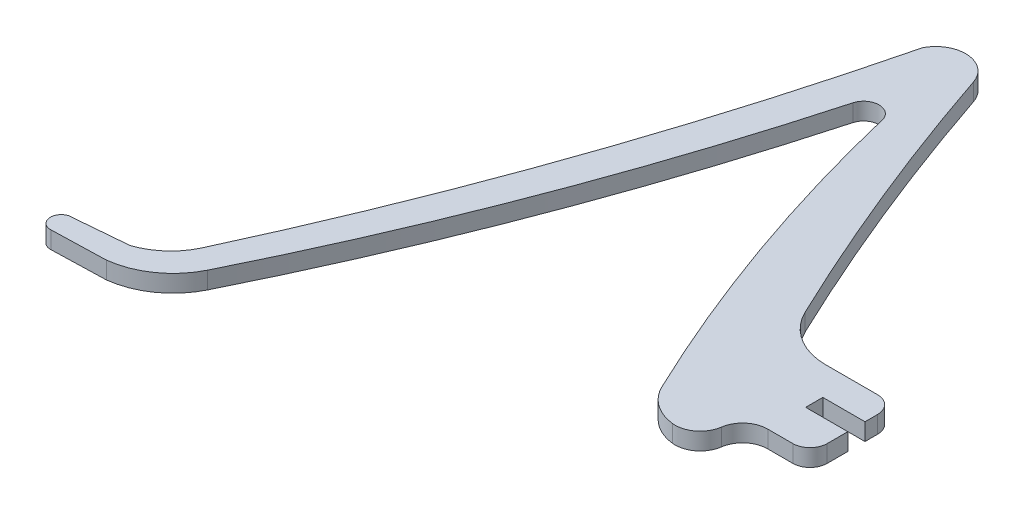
ISO-10303-21;
HEADER;
FILE_DESCRIPTION(('STEP AP214'),'2;1');
FILE_NAME('part.step','',(''),(''),'','','');
FILE_SCHEMA(('AUTOMOTIVE_DESIGN { 1 0 10303 214 1 1 1 1 }'));
ENDSEC;
DATA;
#1=APPLICATION_CONTEXT('core data for automotive mechanical design processes');
#2=APPLICATION_PROTOCOL_DEFINITION('international standard','automotive_design',2000,#1);
#3=PRODUCT_CONTEXT('',#1,'mechanical');
#4=PRODUCT('Part','Part','',(#3));
#5=PRODUCT_RELATED_PRODUCT_CATEGORY('part','',(#4));
#6=PRODUCT_DEFINITION_FORMATION('','',#4);
#7=PRODUCT_DEFINITION_CONTEXT('part definition',#1,'design');
#8=PRODUCT_DEFINITION('design','',#6,#7);
#9=PRODUCT_DEFINITION_SHAPE('','',#8);
#10=(LENGTH_UNIT() NAMED_UNIT(*) SI_UNIT(.MILLI.,.METRE.));
#11=(NAMED_UNIT(*) PLANE_ANGLE_UNIT() SI_UNIT($,.RADIAN.));
#12=(NAMED_UNIT(*) SI_UNIT($,.STERADIAN.) SOLID_ANGLE_UNIT());
#13=UNCERTAINTY_MEASURE_WITH_UNIT(LENGTH_MEASURE(1.E-05),#10,'distance_accuracy_value','');
#14=(GEOMETRIC_REPRESENTATION_CONTEXT(3) GLOBAL_UNCERTAINTY_ASSIGNED_CONTEXT((#13)) GLOBAL_UNIT_ASSIGNED_CONTEXT((#10,
#11,#12)) REPRESENTATION_CONTEXT('',''));
#15=CARTESIAN_POINT('',(0.,0.,0.));
#16=DIRECTION('',(0.,0.,1.));
#17=DIRECTION('',(1.,0.,0.));
#18=AXIS2_PLACEMENT_3D('',#15,#16,#17);
#19=CARTESIAN_POINT('',(-41735.625000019,3.,-18254.4492183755));
#20=DIRECTION('',(0.,-1.,0.));
#21=DIRECTION('',(0.,0.,-1.));
#22=AXIS2_PLACEMENT_3D('',#19,#20,#21);
#23=CYLINDRICAL_SURFACE('',#22,1.87725105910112);
#24=CARTESIAN_POINT('',(-41735.625000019,0.,-18254.4492183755));
#25=DIRECTION('',(0.,1.,0.));
#26=DIRECTION('',(0.,0.,1.));
#27=AXIS2_PLACEMENT_3D('',#24,#25,#26);
#28=CIRCLE('',#27,1.87725105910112);
#29=CARTESIAN_POINT('',(-41735.457558,0.,-18256.318987));
#30=VERTEX_POINT('',#29);
#31=CARTESIAN_POINT('',(-41735.572271,0.,-18252.572708));
#32=VERTEX_POINT('',#31);
#33=EDGE_CURVE('E228',#30,#32,#28,.T.);
#34=ORIENTED_EDGE('',*,*,#33,.T.);
#35=DIRECTION('',(0.,-1.,0.));
#36=VECTOR('',#35,1.);
#37=CARTESIAN_POINT('',(-41735.572271,3.,-18252.572708));
#38=LINE('',#37,#36);
#39=CARTESIAN_POINT('',(-41735.572271,3.,-18252.572708));
#40=VERTEX_POINT('',#39);
#41=EDGE_CURVE('E11',#40,#32,#38,.T.);
#42=ORIENTED_EDGE('',*,*,#41,.F.);
#43=CARTESIAN_POINT('',(-41735.625000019,3.,-18254.4492183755));
#44=DIRECTION('',(0.,1.,0.));
#45=DIRECTION('',(0.,0.,1.));
#46=AXIS2_PLACEMENT_3D('',#43,#44,#45);
#47=CIRCLE('',#46,1.87725105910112);
#48=CARTESIAN_POINT('',(-41735.457558,3.,-18256.318987));
#49=VERTEX_POINT('',#48);
#50=EDGE_CURVE('E274',#49,#40,#47,.T.);
#51=ORIENTED_EDGE('',*,*,#50,.F.);
#52=DIRECTION('',(0.,-1.,0.));
#53=VECTOR('',#52,1.);
#54=CARTESIAN_POINT('',(-41735.457558,3.,-18256.318987));
#55=LINE('',#54,#53);
#56=EDGE_CURVE('E224',#49,#30,#55,.T.);
#57=ORIENTED_EDGE('',*,*,#56,.T.);
#58=EDGE_LOOP('',(#34,#42,#51,#57));
#59=FACE_BOUND('',#58,.T.);
#60=ADVANCED_FACE('F36',(#59),#23,.T.);
#61=CARTESIAN_POINT('',(-41735.572271,3.,-18252.572708));
#62=DIRECTION('',(-0.0283472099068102,0.,-0.999598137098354));
#63=DIRECTION('',(-0.999598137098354,0.,0.0283472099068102));
#64=AXIS2_PLACEMENT_3D('',#61,#62,#63);
#65=PLANE('',#64);
#66=DIRECTION('',(0.999598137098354,0.,-0.0283472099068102));
#67=VECTOR('',#66,1.);
#68=CARTESIAN_POINT('',(-41735.572271,0.,-18252.572708));
#69=LINE('',#68,#67);
#70=CARTESIAN_POINT('',(-41726.152344,0.,-18252.839844));
#71=VERTEX_POINT('',#70);
#72=EDGE_CURVE('E231',#32,#71,#69,.T.);
#73=ORIENTED_EDGE('',*,*,#72,.T.);
#74=DIRECTION('',(0.,-1.,0.));
#75=VECTOR('',#74,1.);
#76=CARTESIAN_POINT('',(-41726.152344,3.,-18252.839844));
#77=LINE('',#76,#75);
#78=CARTESIAN_POINT('',(-41726.152344,3.,-18252.839844));
#79=VERTEX_POINT('',#78);
#80=EDGE_CURVE('E44',#79,#71,#77,.T.);
#81=ORIENTED_EDGE('',*,*,#80,.F.);
#82=DIRECTION('',(0.999598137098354,0.,-0.0283472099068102));
#83=VECTOR('',#82,1.);
#84=CARTESIAN_POINT('',(-41735.572271,3.,-18252.572708));
#85=LINE('',#84,#83);
#86=EDGE_CURVE('E143',#40,#79,#85,.T.);
#87=ORIENTED_EDGE('',*,*,#86,.F.);
#88=ORIENTED_EDGE('',*,*,#41,.T.);
#89=EDGE_LOOP('',(#73,#81,#87,#88));
#90=FACE_BOUND('',#89,.T.);
#91=ADVANCED_FACE('F412',(#90),#65,.F.);
#92=CARTESIAN_POINT('',(-41727.6986479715,3.,-18266.0433719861));
#93=DIRECTION('',(0.,-1.,0.));
#94=DIRECTION('',(0.,0.,-1.));
#95=AXIS2_PLACEMENT_3D('',#92,#93,#94);
#96=CYLINDRICAL_SURFACE('',#95,13.2937657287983);
#97=CARTESIAN_POINT('',(-41727.6986479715,0.,-18266.0433719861));
#98=DIRECTION('',(0.,1.,0.));
#99=DIRECTION('',(0.,0.,1.));
#100=AXIS2_PLACEMENT_3D('',#97,#98,#99);
#101=CIRCLE('',#100,13.2937657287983);
#102=CARTESIAN_POINT('',(-41715.7765399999,0.,-18260.162254));
#103=VERTEX_POINT('',#102);
#104=EDGE_CURVE('E233',#71,#103,#101,.T.);
#105=ORIENTED_EDGE('',*,*,#104,.T.);
#106=DIRECTION('',(0.,-1.,0.));
#107=VECTOR('',#106,1.);
#108=CARTESIAN_POINT('',(-41715.7765399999,3.,-18260.162254));
#109=LINE('',#108,#107);
#110=CARTESIAN_POINT('',(-41715.7765399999,3.,-18260.162254));
#111=VERTEX_POINT('',#110);
#112=EDGE_CURVE('E329',#111,#103,#109,.T.);
#113=ORIENTED_EDGE('',*,*,#112,.F.);
#114=CARTESIAN_POINT('',(-41727.6986479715,3.,-18266.0433719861));
#115=DIRECTION('',(0.,1.,0.));
#116=DIRECTION('',(0.,0.,1.));
#117=AXIS2_PLACEMENT_3D('',#114,#115,#116);
#118=CIRCLE('',#117,13.2937657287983);
#119=EDGE_CURVE('E337',#79,#111,#118,.T.);
#120=ORIENTED_EDGE('',*,*,#119,.F.);
#121=ORIENTED_EDGE('',*,*,#80,.T.);
#122=EDGE_LOOP('',(#105,#113,#120,#121));
#123=FACE_BOUND('',#122,.T.);
#124=ADVANCED_FACE('F335',(#123),#96,.T.);
#125=CARTESIAN_POINT('',(-42128.6616567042,3.,-18463.785625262));
#126=DIRECTION('',(0.,-1.,0.));
#127=DIRECTION('',(0.,0.,-1.));
#128=AXIS2_PLACEMENT_3D('',#125,#126,#127);
#129=CYLINDRICAL_SURFACE('',#128,460.365720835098);
#130=CARTESIAN_POINT('',(-42128.6616567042,0.,-18463.785625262));
#131=DIRECTION('',(0.,1.,0.));
#132=DIRECTION('',(0.,0.,1.));
#133=AXIS2_PLACEMENT_3D('',#130,#131,#132);
#134=CIRCLE('',#133,460.365720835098);
#135=CARTESIAN_POINT('',(-41684.7636980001,0.,-18341.7561239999));
#136=VERTEX_POINT('',#135);
#137=EDGE_CURVE('E235',#103,#136,#134,.T.);
#138=ORIENTED_EDGE('',*,*,#137,.T.);
#139=DIRECTION('',(0.,-1.,0.));
#140=VECTOR('',#139,1.);
#141=CARTESIAN_POINT('',(-41684.7636980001,3.,-18341.7561239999));
#142=LINE('',#141,#140);
#143=CARTESIAN_POINT('',(-41684.7636980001,3.,-18341.7561239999));
#144=VERTEX_POINT('',#143);
#145=EDGE_CURVE('E326',#144,#136,#142,.T.);
#146=ORIENTED_EDGE('',*,*,#145,.F.);
#147=CARTESIAN_POINT('',(-42128.6616567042,3.,-18463.785625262));
#148=DIRECTION('',(0.,1.,0.));
#149=DIRECTION('',(0.,0.,1.));
#150=AXIS2_PLACEMENT_3D('',#147,#148,#149);
#151=CIRCLE('',#150,460.365720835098);
#152=EDGE_CURVE('E355',#111,#144,#151,.T.);
#153=ORIENTED_EDGE('',*,*,#152,.F.);
#154=ORIENTED_EDGE('',*,*,#112,.T.);
#155=EDGE_LOOP('',(#138,#146,#153,#154));
#156=FACE_BOUND('',#155,.T.);
#157=ADVANCED_FACE('F346',(#156),#129,.T.);
#158=CARTESIAN_POINT('',(-41682.171002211,3.,-18341.0430255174));
#159=DIRECTION('',(0.,-1.,0.));
#160=DIRECTION('',(0.,0.,-1.));
#161=AXIS2_PLACEMENT_3D('',#158,#159,#160);
#162=CYLINDRICAL_SURFACE('',#161,2.6889739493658);
#163=CARTESIAN_POINT('',(-41682.171002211,0.,-18341.0430255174));
#164=DIRECTION('',(0.,-1.,0.));
#165=DIRECTION('',(0.,0.,1.));
#166=AXIS2_PLACEMENT_3D('',#163,#164,#165);
#167=CIRCLE('',#166,2.6889739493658);
#168=CARTESIAN_POINT('',(-41679.691927,0.,-18342.084547));
#169=VERTEX_POINT('',#168);
#170=EDGE_CURVE('E237',#136,#169,#167,.T.);
#171=ORIENTED_EDGE('',*,*,#170,.T.);
#172=DIRECTION('',(0.,-1.,0.));
#173=VECTOR('',#172,1.);
#174=CARTESIAN_POINT('',(-41679.691927,3.,-18342.084547));
#175=LINE('',#174,#173);
#176=CARTESIAN_POINT('',(-41679.691927,3.,-18342.084547));
#177=VERTEX_POINT('',#176);
#178=EDGE_CURVE('E323',#177,#169,#175,.T.);
#179=ORIENTED_EDGE('',*,*,#178,.F.);
#180=CARTESIAN_POINT('',(-41682.171002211,3.,-18341.0430255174));
#181=DIRECTION('',(0.,-1.,0.));
#182=DIRECTION('',(0.,0.,1.));
#183=AXIS2_PLACEMENT_3D('',#180,#181,#182);
#184=CIRCLE('',#183,2.6889739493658);
#185=EDGE_CURVE('E352',#144,#177,#184,.T.);
#186=ORIENTED_EDGE('',*,*,#185,.F.);
#187=ORIENTED_EDGE('',*,*,#145,.T.);
#188=EDGE_LOOP('',(#171,#179,#186,#187));
#189=FACE_BOUND('',#188,.T.);
#190=ADVANCED_FACE('F350',(#189),#162,.F.);
#191=CARTESIAN_POINT('',(-41387.5740004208,3.,-18411.7109974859));
#192=DIRECTION('',(0.,-1.,0.));
#193=DIRECTION('',(0.,0.,-1.));
#194=AXIS2_PLACEMENT_3D('',#191,#192,#193);
#195=CYLINDRICAL_SURFACE('',#194,300.3010583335);
#196=CARTESIAN_POINT('',(-41387.5740004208,0.,-18411.7109974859));
#197=DIRECTION('',(0.,1.,0.));
#198=DIRECTION('',(0.,0.,1.));
#199=AXIS2_PLACEMENT_3D('',#196,#197,#198);
#200=CIRCLE('',#199,300.3010583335);
#201=CARTESIAN_POINT('',(-41658.4870259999,0.,-18282.1468889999));
#202=VERTEX_POINT('',#201);
#203=EDGE_CURVE('E239',#169,#202,#200,.T.);
#204=ORIENTED_EDGE('',*,*,#203,.T.);
#205=DIRECTION('',(0.,-1.,0.));
#206=VECTOR('',#205,1.);
#207=CARTESIAN_POINT('',(-41658.4870259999,3.,-18282.1468889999));
#208=LINE('',#207,#206);
#209=CARTESIAN_POINT('',(-41658.4870259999,3.,-18282.1468889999));
#210=VERTEX_POINT('',#209);
#211=EDGE_CURVE('E320',#210,#202,#208,.T.);
#212=ORIENTED_EDGE('',*,*,#211,.F.);
#213=CARTESIAN_POINT('',(-41387.5740004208,3.,-18411.7109974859));
#214=DIRECTION('',(0.,1.,0.));
#215=DIRECTION('',(0.,0.,1.));
#216=AXIS2_PLACEMENT_3D('',#213,#214,#215);
#217=CIRCLE('',#216,300.3010583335);
#218=EDGE_CURVE('E354',#177,#210,#217,.T.);
#219=ORIENTED_EDGE('',*,*,#218,.F.);
#220=ORIENTED_EDGE('',*,*,#178,.T.);
#221=EDGE_LOOP('',(#204,#212,#219,#220));
#222=FACE_BOUND('',#221,.T.);
#223=ADVANCED_FACE('F425',(#222),#195,.T.);
#224=CARTESIAN_POINT('',(-41651.1032537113,3.,-18285.6789434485));
#225=DIRECTION('',(0.,-1.,0.));
#226=DIRECTION('',(0.,0.,-1.));
#227=AXIS2_PLACEMENT_3D('',#224,#225,#226);
#228=CYLINDRICAL_SURFACE('',#227,8.1850779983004);
#229=CARTESIAN_POINT('',(-41651.1032537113,0.,-18285.6789434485));
#230=DIRECTION('',(0.,1.,0.));
#231=DIRECTION('',(0.,0.,1.));
#232=AXIS2_PLACEMENT_3D('',#229,#230,#231);
#233=CIRCLE('',#232,8.1850779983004);
#234=CARTESIAN_POINT('',(-41652.056541,0.,-18277.5495679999));
#235=VERTEX_POINT('',#234);
#236=EDGE_CURVE('E241',#202,#235,#233,.T.);
#237=ORIENTED_EDGE('',*,*,#236,.T.);
#238=DIRECTION('',(0.,-1.,0.));
#239=VECTOR('',#238,1.);
#240=CARTESIAN_POINT('',(-41652.056541,3.,-18277.5495679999));
#241=LINE('',#240,#239);
#242=CARTESIAN_POINT('',(-41652.056541,3.,-18277.5495679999));
#243=VERTEX_POINT('',#242);
#244=EDGE_CURVE('E317',#243,#235,#241,.T.);
#245=ORIENTED_EDGE('',*,*,#244,.F.);
#246=CARTESIAN_POINT('',(-41651.1032537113,3.,-18285.6789434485));
#247=DIRECTION('',(0.,1.,0.));
#248=DIRECTION('',(0.,0.,1.));
#249=AXIS2_PLACEMENT_3D('',#246,#247,#248);
#250=CIRCLE('',#249,8.1850779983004);
#251=EDGE_CURVE('E357',#210,#243,#250,.T.);
#252=ORIENTED_EDGE('',*,*,#251,.F.);
#253=ORIENTED_EDGE('',*,*,#211,.T.);
#254=EDGE_LOOP('',(#237,#245,#252,#253));
#255=FACE_BOUND('',#254,.T.);
#256=ADVANCED_FACE('F428',(#255),#228,.T.);
#257=CARTESIAN_POINT('',(-41651.5439153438,3.,-18281.889896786));
#258=DIRECTION('',(0.,-1.,0.));
#259=DIRECTION('',(0.,0.,-1.));
#260=AXIS2_PLACEMENT_3D('',#257,#258,#259);
#261=CYLINDRICAL_SURFACE('',#260,4.37049642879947);
#262=CARTESIAN_POINT('',(-41651.5439153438,0.,-18281.889896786));
#263=DIRECTION('',(0.,1.,0.));
#264=DIRECTION('',(0.,0.,1.));
#265=AXIS2_PLACEMENT_3D('',#262,#263,#264);
#266=CIRCLE('',#265,4.37049642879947);
#267=CARTESIAN_POINT('',(-41647.2171,0.,-18281.27353));
#268=VERTEX_POINT('',#267);
#269=EDGE_CURVE('E243',#235,#268,#266,.T.);
#270=ORIENTED_EDGE('',*,*,#269,.T.);
#271=DIRECTION('',(0.,-1.,0.));
#272=VECTOR('',#271,1.);
#273=CARTESIAN_POINT('',(-41647.2171,3.,-18281.27353));
#274=LINE('',#273,#272);
#275=CARTESIAN_POINT('',(-41647.2171,3.,-18281.27353));
#276=VERTEX_POINT('',#275);
#277=EDGE_CURVE('E314',#276,#268,#274,.T.);
#278=ORIENTED_EDGE('',*,*,#277,.F.);
#279=CARTESIAN_POINT('',(-41651.5439153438,3.,-18281.889896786));
#280=DIRECTION('',(0.,1.,0.));
#281=DIRECTION('',(0.,0.,1.));
#282=AXIS2_PLACEMENT_3D('',#279,#280,#281);
#283=CIRCLE('',#282,4.37049642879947);
#284=EDGE_CURVE('E363',#243,#276,#283,.T.);
#285=ORIENTED_EDGE('',*,*,#284,.F.);
#286=ORIENTED_EDGE('',*,*,#244,.T.);
#287=EDGE_LOOP('',(#270,#278,#285,#286));
#288=FACE_BOUND('',#287,.T.);
#289=ADVANCED_FACE('F432',(#288),#261,.T.);
#290=CARTESIAN_POINT('',(-41642.9057210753,3.,-18280.6586579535));
#291=DIRECTION('',(0.,-1.,0.));
#292=DIRECTION('',(0.,0.,-1.));
#293=AXIS2_PLACEMENT_3D('',#290,#291,#292);
#294=CYLINDRICAL_SURFACE('',#293,4.35500354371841);
#295=CARTESIAN_POINT('',(-41642.9057210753,0.,-18280.6586579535));
#296=DIRECTION('',(0.,-1.,0.));
#297=DIRECTION('',(0.,0.,1.));
#298=AXIS2_PLACEMENT_3D('',#295,#296,#297);
#299=CIRCLE('',#298,4.35500354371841);
#300=CARTESIAN_POINT('',(-41642.869038,0.,-18285.013507));
#301=VERTEX_POINT('',#300);
#302=EDGE_CURVE('E245',#268,#301,#299,.T.);
#303=ORIENTED_EDGE('',*,*,#302,.T.);
#304=DIRECTION('',(0.,-1.,0.));
#305=VECTOR('',#304,1.);
#306=CARTESIAN_POINT('',(-41642.869038,3.,-18285.013507));
#307=LINE('',#306,#305);
#308=CARTESIAN_POINT('',(-41642.869038,3.,-18285.013507));
#309=VERTEX_POINT('',#308);
#310=EDGE_CURVE('E311',#309,#301,#307,.T.);
#311=ORIENTED_EDGE('',*,*,#310,.F.);
#312=CARTESIAN_POINT('',(-41642.9057210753,3.,-18280.6586579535));
#313=DIRECTION('',(0.,-1.,0.));
#314=DIRECTION('',(0.,0.,1.));
#315=AXIS2_PLACEMENT_3D('',#312,#313,#314);
#316=CIRCLE('',#315,4.35500354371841);
#317=EDGE_CURVE('E365',#276,#309,#316,.T.);
#318=ORIENTED_EDGE('',*,*,#317,.F.);
#319=ORIENTED_EDGE('',*,*,#277,.T.);
#320=EDGE_LOOP('',(#303,#311,#318,#319));
#321=FACE_BOUND('',#320,.T.);
#322=ADVANCED_FACE('F436',(#321),#294,.F.);
#323=CARTESIAN_POINT('',(-41642.869038,3.,-18285.013507));
#324=DIRECTION('',(-3.77320231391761E-05,0.,-0.999999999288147));
#325=DIRECTION('',(-0.999999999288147,0.,3.77320231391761E-05));
#326=AXIS2_PLACEMENT_3D('',#323,#324,#325);
#327=PLANE('',#326);
#328=DIRECTION('',(0.999999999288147,0.,-3.77320231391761E-05));
#329=VECTOR('',#328,1.);
#330=CARTESIAN_POINT('',(-41642.869038,0.,-18285.013507));
#331=LINE('',#330,#329);
#332=CARTESIAN_POINT('',(-41638.496094,0.,-18285.013672));
#333=VERTEX_POINT('',#332);
#334=EDGE_CURVE('E247',#301,#333,#331,.T.);
#335=ORIENTED_EDGE('',*,*,#334,.T.);
#336=DIRECTION('',(0.,-1.,0.));
#337=VECTOR('',#336,1.);
#338=CARTESIAN_POINT('',(-41638.496094,3.,-18285.013672));
#339=LINE('',#338,#337);
#340=CARTESIAN_POINT('',(-41638.496094,3.,-18285.013672));
#341=VERTEX_POINT('',#340);
#342=EDGE_CURVE('E308',#341,#333,#339,.T.);
#343=ORIENTED_EDGE('',*,*,#342,.F.);
#344=DIRECTION('',(0.999999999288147,0.,-3.77320231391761E-05));
#345=VECTOR('',#344,1.);
#346=CARTESIAN_POINT('',(-41642.869038,3.,-18285.013507));
#347=LINE('',#346,#345);
#348=EDGE_CURVE('E367',#309,#341,#347,.T.);
#349=ORIENTED_EDGE('',*,*,#348,.F.);
#350=ORIENTED_EDGE('',*,*,#310,.T.);
#351=EDGE_LOOP('',(#335,#343,#349,#350));
#352=FACE_BOUND('',#351,.T.);
#353=ADVANCED_FACE('F440',(#352),#327,.F.);
#354=CARTESIAN_POINT('',(-41638.4970694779,3.,-18288.014648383));
#355=DIRECTION('',(0.,-1.,0.));
#356=DIRECTION('',(0.,0.,-1.));
#357=AXIS2_PLACEMENT_3D('',#354,#355,#356);
#358=CYLINDRICAL_SURFACE('',#357,3.00097654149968);
#359=CARTESIAN_POINT('',(-41638.4970694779,0.,-18288.014648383));
#360=DIRECTION('',(0.,1.,0.));
#361=DIRECTION('',(0.,0.,1.));
#362=AXIS2_PLACEMENT_3D('',#359,#360,#361);
#363=CIRCLE('',#362,3.00097654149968);
#364=CARTESIAN_POINT('',(-41635.496094,0.,-18288.017175));
#365=VERTEX_POINT('',#364);
#366=EDGE_CURVE('E249',#333,#365,#363,.T.);
#367=ORIENTED_EDGE('',*,*,#366,.T.);
#368=DIRECTION('',(0.,-1.,0.));
#369=VECTOR('',#368,1.);
#370=CARTESIAN_POINT('',(-41635.496094,3.,-18288.017175));
#371=LINE('',#370,#369);
#372=CARTESIAN_POINT('',(-41635.496094,3.,-18288.017175));
#373=VERTEX_POINT('',#372);
#374=EDGE_CURVE('E305',#373,#365,#371,.T.);
#375=ORIENTED_EDGE('',*,*,#374,.F.);
#376=CARTESIAN_POINT('',(-41638.4970694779,3.,-18288.014648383));
#377=DIRECTION('',(0.,1.,0.));
#378=DIRECTION('',(0.,0.,1.));
#379=AXIS2_PLACEMENT_3D('',#376,#377,#378);
#380=CIRCLE('',#379,3.00097654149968);
#381=EDGE_CURVE('E369',#341,#373,#380,.T.);
#382=ORIENTED_EDGE('',*,*,#381,.F.);
#383=ORIENTED_EDGE('',*,*,#342,.T.);
#384=EDGE_LOOP('',(#367,#375,#382,#383));
#385=FACE_BOUND('',#384,.T.);
#386=ADVANCED_FACE('F444',(#385),#358,.T.);
#387=CARTESIAN_POINT('',(-41635.496094,3.,-18288.017175));
#388=DIRECTION('',(-1.,0.,-3.95388140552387E-12));
#389=DIRECTION('',(-3.95388140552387E-12,0.,1.));
#390=AXIS2_PLACEMENT_3D('',#387,#388,#389);
#391=PLANE('',#390);
#392=DIRECTION('',(3.95388140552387E-12,0.,-1.));
#393=VECTOR('',#392,1.);
#394=CARTESIAN_POINT('',(-41635.496094,0.,-18288.017175));
#395=LINE('',#394,#393);
#396=CARTESIAN_POINT('',(-41635.496094,0.,-18291.611328));
#397=VERTEX_POINT('',#396);
#398=EDGE_CURVE('E251',#365,#397,#395,.T.);
#399=ORIENTED_EDGE('',*,*,#398,.T.);
#400=DIRECTION('',(0.,-1.,0.));
#401=VECTOR('',#400,1.);
#402=CARTESIAN_POINT('',(-41635.496094,3.,-18291.611328));
#403=LINE('',#402,#401);
#404=CARTESIAN_POINT('',(-41635.496094,3.,-18291.611328));
#405=VERTEX_POINT('',#404);
#406=EDGE_CURVE('E302',#405,#397,#403,.T.);
#407=ORIENTED_EDGE('',*,*,#406,.F.);
#408=DIRECTION('',(3.95388140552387E-12,0.,-1.));
#409=VECTOR('',#408,1.);
#410=CARTESIAN_POINT('',(-41635.496094,3.,-18288.017175));
#411=LINE('',#410,#409);
#412=EDGE_CURVE('E371',#373,#405,#411,.T.);
#413=ORIENTED_EDGE('',*,*,#412,.F.);
#414=ORIENTED_EDGE('',*,*,#374,.T.);
#415=EDGE_LOOP('',(#399,#407,#413,#414));
#416=FACE_BOUND('',#415,.T.);
#417=ADVANCED_FACE('F448',(#416),#391,.F.);
#418=CARTESIAN_POINT('',(-41635.496094,3.,-18291.611328));
#419=DIRECTION('',(0.,0.,1.));
#420=DIRECTION('',(1.,0.,0.));
#421=AXIS2_PLACEMENT_3D('',#418,#419,#420);
#422=PLANE('',#421);
#423=DIRECTION('',(-1.,0.,0.));
#424=VECTOR('',#423,1.);
#425=CARTESIAN_POINT('',(-41635.496094,0.,-18291.611328));
#426=LINE('',#425,#424);
#427=CARTESIAN_POINT('',(-41642.855469,0.,-18291.611328));
#428=VERTEX_POINT('',#427);
#429=EDGE_CURVE('E253',#397,#428,#426,.T.);
#430=ORIENTED_EDGE('',*,*,#429,.T.);
#431=DIRECTION('',(0.,-1.,0.));
#432=VECTOR('',#431,1.);
#433=CARTESIAN_POINT('',(-41642.855469,3.,-18291.611328));
#434=LINE('',#433,#432);
#435=CARTESIAN_POINT('',(-41642.855469,3.,-18291.611328));
#436=VERTEX_POINT('',#435);
#437=EDGE_CURVE('E299',#436,#428,#434,.T.);
#438=ORIENTED_EDGE('',*,*,#437,.F.);
#439=DIRECTION('',(-1.,0.,0.));
#440=VECTOR('',#439,1.);
#441=CARTESIAN_POINT('',(-41635.496094,3.,-18291.611328));
#442=LINE('',#441,#440);
#443=EDGE_CURVE('E373',#405,#436,#442,.T.);
#444=ORIENTED_EDGE('',*,*,#443,.F.);
#445=ORIENTED_EDGE('',*,*,#406,.T.);
#446=EDGE_LOOP('',(#430,#438,#444,#445));
#447=FACE_BOUND('',#446,.T.);
#448=ADVANCED_FACE('F452',(#447),#422,.F.);
#449=CARTESIAN_POINT('',(-41642.855469,3.,-18291.611328));
#450=DIRECTION('',(-0.999999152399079,0.,0.00130199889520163));
#451=DIRECTION('',(0.00130199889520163,0.,0.999999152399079));
#452=AXIS2_PLACEMENT_3D('',#449,#450,#451);
#453=PLANE('',#452);
#454=DIRECTION('',(-0.00130199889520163,0.,-0.999999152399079));
#455=VECTOR('',#454,1.);
#456=CARTESIAN_POINT('',(-41642.855469,0.,-18291.611328));
#457=LINE('',#456,#455);
#458=CARTESIAN_POINT('',(-41642.859375,0.,-18294.611328));
#459=VERTEX_POINT('',#458);
#460=EDGE_CURVE('E255',#428,#459,#457,.T.);
#461=ORIENTED_EDGE('',*,*,#460,.T.);
#462=DIRECTION('',(0.,-1.,0.));
#463=VECTOR('',#462,1.);
#464=CARTESIAN_POINT('',(-41642.859375,3.,-18294.611328));
#465=LINE('',#464,#463);
#466=CARTESIAN_POINT('',(-41642.859375,3.,-18294.611328));
#467=VERTEX_POINT('',#466);
#468=EDGE_CURVE('E296',#467,#459,#465,.T.);
#469=ORIENTED_EDGE('',*,*,#468,.F.);
#470=DIRECTION('',(-0.00130199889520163,0.,-0.999999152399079));
#471=VECTOR('',#470,1.);
#472=CARTESIAN_POINT('',(-41642.855469,3.,-18291.611328));
#473=LINE('',#472,#471);
#474=EDGE_CURVE('E375',#436,#467,#473,.T.);
#475=ORIENTED_EDGE('',*,*,#474,.F.);
#476=ORIENTED_EDGE('',*,*,#437,.T.);
#477=EDGE_LOOP('',(#461,#469,#475,#476));
#478=FACE_BOUND('',#477,.T.);
#479=ADVANCED_FACE('F456',(#478),#453,.F.);
#480=CARTESIAN_POINT('',(-41642.859375,3.,-18294.611328));
#481=DIRECTION('',(0.,0.,-1.));
#482=DIRECTION('',(-1.,0.,0.));
#483=AXIS2_PLACEMENT_3D('',#480,#481,#482);
#484=PLANE('',#483);
#485=DIRECTION('',(1.,0.,0.));
#486=VECTOR('',#485,1.);
#487=CARTESIAN_POINT('',(-41642.859375,0.,-18294.611328));
#488=LINE('',#487,#486);
#489=CARTESIAN_POINT('',(-41635.5,0.,-18294.611328));
#490=VERTEX_POINT('',#489);
#491=EDGE_CURVE('E257',#459,#490,#488,.T.);
#492=ORIENTED_EDGE('',*,*,#491,.T.);
#493=DIRECTION('',(0.,-1.,0.));
#494=VECTOR('',#493,1.);
#495=CARTESIAN_POINT('',(-41635.5,3.,-18294.611328));
#496=LINE('',#495,#494);
#497=CARTESIAN_POINT('',(-41635.5,3.,-18294.611328));
#498=VERTEX_POINT('',#497);
#499=EDGE_CURVE('E293',#498,#490,#496,.T.);
#500=ORIENTED_EDGE('',*,*,#499,.F.);
#501=DIRECTION('',(1.,0.,0.));
#502=VECTOR('',#501,1.);
#503=CARTESIAN_POINT('',(-41642.859375,3.,-18294.611328));
#504=LINE('',#503,#502);
#505=EDGE_CURVE('E377',#467,#498,#504,.T.);
#506=ORIENTED_EDGE('',*,*,#505,.F.);
#507=ORIENTED_EDGE('',*,*,#468,.T.);
#508=EDGE_LOOP('',(#492,#500,#506,#507));
#509=FACE_BOUND('',#508,.T.);
#510=ADVANCED_FACE('F460',(#509),#484,.F.);
#511=CARTESIAN_POINT('',(-41635.5,3.,-18294.611328));
#512=DIRECTION('',(-0.999998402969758,0.,-0.00178719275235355));
#513=DIRECTION('',(-0.00178719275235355,0.,0.999998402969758));
#514=AXIS2_PLACEMENT_3D('',#511,#512,#513);
#515=PLANE('',#514);
#516=DIRECTION('',(0.00178719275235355,0.,-0.999998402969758));
#517=VECTOR('',#516,1.);
#518=CARTESIAN_POINT('',(-41635.5,0.,-18294.611328));
#519=LINE('',#518,#517);
#520=CARTESIAN_POINT('',(-41635.496094,0.,-18296.796875));
#521=VERTEX_POINT('',#520);
#522=EDGE_CURVE('E259',#490,#521,#519,.T.);
#523=ORIENTED_EDGE('',*,*,#522,.T.);
#524=DIRECTION('',(0.,-1.,0.));
#525=VECTOR('',#524,1.);
#526=CARTESIAN_POINT('',(-41635.496094,3.,-18296.796875));
#527=LINE('',#526,#525);
#528=CARTESIAN_POINT('',(-41635.496094,3.,-18296.796875));
#529=VERTEX_POINT('',#528);
#530=EDGE_CURVE('E290',#529,#521,#527,.T.);
#531=ORIENTED_EDGE('',*,*,#530,.F.);
#532=DIRECTION('',(0.00178719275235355,0.,-0.999998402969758));
#533=VECTOR('',#532,1.);
#534=CARTESIAN_POINT('',(-41635.5,3.,-18294.611328));
#535=LINE('',#534,#533);
#536=EDGE_CURVE('E379',#498,#529,#535,.T.);
#537=ORIENTED_EDGE('',*,*,#536,.F.);
#538=ORIENTED_EDGE('',*,*,#499,.T.);
#539=EDGE_LOOP('',(#523,#531,#537,#538));
#540=FACE_BOUND('',#539,.T.);
#541=ADVANCED_FACE('F464',(#540),#515,.F.);
#542=CARTESIAN_POINT('',(-41638.496094,3.,-18296.796875));
#543=DIRECTION('',(0.,-1.,0.));
#544=DIRECTION('',(0.,0.,-1.));
#545=AXIS2_PLACEMENT_3D('',#542,#543,#544);
#546=CYLINDRICAL_SURFACE('',#545,3.00000000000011);
#547=CARTESIAN_POINT('',(-41638.496094,0.,-18296.796875));
#548=DIRECTION('',(0.,1.,0.));
#549=DIRECTION('',(0.,0.,1.));
#550=AXIS2_PLACEMENT_3D('',#547,#548,#549);
#551=CIRCLE('',#550,3.00000000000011);
#552=CARTESIAN_POINT('',(-41638.496094,0.,-18299.796875));
#553=VERTEX_POINT('',#552);
#554=EDGE_CURVE('E261',#521,#553,#551,.T.);
#555=ORIENTED_EDGE('',*,*,#554,.T.);
#556=DIRECTION('',(0.,-1.,0.));
#557=VECTOR('',#556,1.);
#558=CARTESIAN_POINT('',(-41638.496094,3.,-18299.796875));
#559=LINE('',#558,#557);
#560=CARTESIAN_POINT('',(-41638.496094,3.,-18299.796875));
#561=VERTEX_POINT('',#560);
#562=EDGE_CURVE('E287',#561,#553,#559,.T.);
#563=ORIENTED_EDGE('',*,*,#562,.F.);
#564=CARTESIAN_POINT('',(-41638.496094,3.,-18296.796875));
#565=DIRECTION('',(0.,1.,0.));
#566=DIRECTION('',(0.,0.,1.));
#567=AXIS2_PLACEMENT_3D('',#564,#565,#566);
#568=CIRCLE('',#567,3.00000000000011);
#569=EDGE_CURVE('E381',#529,#561,#568,.T.);
#570=ORIENTED_EDGE('',*,*,#569,.F.);
#571=ORIENTED_EDGE('',*,*,#530,.T.);
#572=EDGE_LOOP('',(#555,#563,#570,#571));
#573=FACE_BOUND('',#572,.T.);
#574=ADVANCED_FACE('F468',(#573),#546,.T.);
#575=CARTESIAN_POINT('',(-41638.496094,3.,-18299.796875));
#576=DIRECTION('',(0.000209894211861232,0.,0.99999997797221));
#577=DIRECTION('',(0.99999997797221,0.,-0.000209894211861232));
#578=AXIS2_PLACEMENT_3D('',#575,#576,#577);
#579=PLANE('',#578);
#580=DIRECTION('',(-0.99999997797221,0.,0.000209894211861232));
#581=VECTOR('',#580,1.);
#582=CARTESIAN_POINT('',(-41638.496094,0.,-18299.796875));
#583=LINE('',#582,#581);
#584=CARTESIAN_POINT('',(-41647.800781,0.,-18299.794922));
#585=VERTEX_POINT('',#584);
#586=EDGE_CURVE('E263',#553,#585,#583,.T.);
#587=ORIENTED_EDGE('',*,*,#586,.T.);
#588=DIRECTION('',(0.,-1.,0.));
#589=VECTOR('',#588,1.);
#590=CARTESIAN_POINT('',(-41647.800781,3.,-18299.794922));
#591=LINE('',#590,#589);
#592=CARTESIAN_POINT('',(-41647.800781,3.,-18299.794922));
#593=VERTEX_POINT('',#592);
#594=EDGE_CURVE('E284',#593,#585,#591,.T.);
#595=ORIENTED_EDGE('',*,*,#594,.F.);
#596=DIRECTION('',(-0.99999997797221,0.,0.000209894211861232));
#597=VECTOR('',#596,1.);
#598=CARTESIAN_POINT('',(-41638.496094,3.,-18299.796875));
#599=LINE('',#598,#597);
#600=EDGE_CURVE('E383',#561,#593,#599,.T.);
#601=ORIENTED_EDGE('',*,*,#600,.F.);
#602=ORIENTED_EDGE('',*,*,#562,.T.);
#603=EDGE_LOOP('',(#587,#595,#601,#602));
#604=FACE_BOUND('',#603,.T.);
#605=ADVANCED_FACE('F472',(#604),#579,.F.);
#606=CARTESIAN_POINT('',(-41647.4981230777,3.,-18310.6472167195));
#607=DIRECTION('',(0.,-1.,0.));
#608=DIRECTION('',(0.,0.,-1.));
#609=AXIS2_PLACEMENT_3D('',#606,#607,#608);
#610=CYLINDRICAL_SURFACE('',#609,10.8565142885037);
#611=CARTESIAN_POINT('',(-41647.4981230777,0.,-18310.6472167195));
#612=DIRECTION('',(0.,-1.,0.));
#613=DIRECTION('',(0.,0.,1.));
#614=AXIS2_PLACEMENT_3D('',#611,#612,#613);
#615=CIRCLE('',#614,10.8565142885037);
#616=CARTESIAN_POINT('',(-41657.2939760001,0.,-18305.9669210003));
#617=VERTEX_POINT('',#616);
#618=EDGE_CURVE('E265',#585,#617,#615,.T.);
#619=ORIENTED_EDGE('',*,*,#618,.T.);
#620=DIRECTION('',(0.,-1.,0.));
#621=VECTOR('',#620,1.);
#622=CARTESIAN_POINT('',(-41657.2939760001,3.,-18305.9669210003));
#623=LINE('',#622,#621);
#624=CARTESIAN_POINT('',(-41657.2939760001,3.,-18305.9669210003));
#625=VERTEX_POINT('',#624);
#626=EDGE_CURVE('E281',#625,#617,#623,.T.);
#627=ORIENTED_EDGE('',*,*,#626,.F.);
#628=CARTESIAN_POINT('',(-41647.4981230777,3.,-18310.6472167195));
#629=DIRECTION('',(0.,-1.,0.));
#630=DIRECTION('',(0.,0.,1.));
#631=AXIS2_PLACEMENT_3D('',#628,#629,#630);
#632=CIRCLE('',#631,10.8565142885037);
#633=EDGE_CURVE('E385',#593,#625,#632,.T.);
#634=ORIENTED_EDGE('',*,*,#633,.F.);
#635=ORIENTED_EDGE('',*,*,#594,.T.);
#636=EDGE_LOOP('',(#619,#627,#634,#635));
#637=FACE_BOUND('',#636,.T.);
#638=ADVANCED_FACE('F476',(#637),#610,.F.);
#639=CARTESIAN_POINT('',(-41255.6337432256,3.,-18497.9731435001));
#640=DIRECTION('',(0.,-1.,0.));
#641=DIRECTION('',(0.,0.,-1.));
#642=AXIS2_PLACEMENT_3D('',#639,#640,#641);
#643=CYLINDRICAL_SURFACE('',#642,445.193589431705);
#644=CARTESIAN_POINT('',(-41255.6337432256,0.,-18497.9731435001));
#645=DIRECTION('',(0.,-1.,0.));
#646=DIRECTION('',(0.,0.,1.));
#647=AXIS2_PLACEMENT_3D('',#644,#645,#646);
#648=CIRCLE('',#647,445.193589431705);
#649=CARTESIAN_POINT('',(-41677.4082949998,0.,-18355.4825839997));
#650=VERTEX_POINT('',#649);
#651=EDGE_CURVE('E267',#617,#650,#648,.T.);
#652=ORIENTED_EDGE('',*,*,#651,.T.);
#653=DIRECTION('',(0.,-1.,0.));
#654=VECTOR('',#653,1.);
#655=CARTESIAN_POINT('',(-41677.4082949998,3.,-18355.4825839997));
#656=LINE('',#655,#654);
#657=CARTESIAN_POINT('',(-41677.4082949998,3.,-18355.4825839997));
#658=VERTEX_POINT('',#657);
#659=EDGE_CURVE('E278',#658,#650,#656,.T.);
#660=ORIENTED_EDGE('',*,*,#659,.F.);
#661=CARTESIAN_POINT('',(-41255.6337432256,3.,-18497.9731435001));
#662=DIRECTION('',(0.,-1.,0.));
#663=DIRECTION('',(0.,0.,1.));
#664=AXIS2_PLACEMENT_3D('',#661,#662,#663);
#665=CIRCLE('',#664,445.193589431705);
#666=EDGE_CURVE('E387',#625,#658,#665,.T.);
#667=ORIENTED_EDGE('',*,*,#666,.F.);
#668=ORIENTED_EDGE('',*,*,#626,.T.);
#669=EDGE_LOOP('',(#652,#660,#667,#668));
#670=FACE_BOUND('',#669,.T.);
#671=ADVANCED_FACE('F393',(#670),#643,.F.);
#672=CARTESIAN_POINT('',(-41682.3550434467,3.,-18353.8124680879));
#673=DIRECTION('',(0.,-1.,0.));
#674=DIRECTION('',(0.,0.,-1.));
#675=AXIS2_PLACEMENT_3D('',#672,#673,#674);
#676=CYLINDRICAL_SURFACE('',#675,5.22107339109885);
#677=CARTESIAN_POINT('',(-41682.3550434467,0.,-18353.8124680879));
#678=DIRECTION('',(0.,1.,0.));
#679=DIRECTION('',(0.,0.,1.));
#680=AXIS2_PLACEMENT_3D('',#677,#678,#679);
#681=CIRCLE('',#680,5.22107339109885);
#682=CARTESIAN_POINT('',(-41686.997382,0.,-18356.201673));
#683=VERTEX_POINT('',#682);
#684=EDGE_CURVE('E269',#650,#683,#681,.T.);
#685=ORIENTED_EDGE('',*,*,#684,.T.);
#686=DIRECTION('',(0.,-1.,0.));
#687=VECTOR('',#686,1.);
#688=CARTESIAN_POINT('',(-41686.997382,3.,-18356.201673));
#689=LINE('',#688,#687);
#690=CARTESIAN_POINT('',(-41686.997382,3.,-18356.201673));
#691=VERTEX_POINT('',#690);
#692=EDGE_CURVE('E219',#691,#683,#689,.T.);
#693=ORIENTED_EDGE('',*,*,#692,.F.);
#694=CARTESIAN_POINT('',(-41682.3550434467,3.,-18353.8124680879));
#695=DIRECTION('',(0.,1.,0.));
#696=DIRECTION('',(0.,0.,1.));
#697=AXIS2_PLACEMENT_3D('',#694,#695,#696);
#698=CIRCLE('',#697,5.22107339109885);
#699=EDGE_CURVE('E210',#658,#691,#698,.T.);
#700=ORIENTED_EDGE('',*,*,#699,.F.);
#701=ORIENTED_EDGE('',*,*,#659,.T.);
#702=EDGE_LOOP('',(#685,#693,#700,#701));
#703=FACE_BOUND('',#702,.T.);
#704=ADVANCED_FACE('F397',(#703),#676,.T.);
#705=CARTESIAN_POINT('',(-42188.2960508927,3.,-18479.4912056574));
#706=DIRECTION('',(0.,-1.,0.));
#707=DIRECTION('',(0.,0.,-1.));
#708=AXIS2_PLACEMENT_3D('',#705,#706,#707);
#709=CYLINDRICAL_SURFACE('',#708,516.237023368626);
#710=CARTESIAN_POINT('',(-42188.2960508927,0.,-18479.4912056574));
#711=DIRECTION('',(0.,-1.,0.));
#712=DIRECTION('',(0.,0.,1.));
#713=AXIS2_PLACEMENT_3D('',#710,#711,#712);
#714=CIRCLE('',#713,516.237023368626);
#715=CARTESIAN_POINT('',(-41719.697677,0.,-18262.8896630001));
#716=VERTEX_POINT('',#715);
#717=EDGE_CURVE('E218',#683,#716,#714,.T.);
#718=ORIENTED_EDGE('',*,*,#717,.T.);
#719=DIRECTION('',(0.,-1.,0.));
#720=VECTOR('',#719,1.);
#721=CARTESIAN_POINT('',(-41719.697677,3.,-18262.8896630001));
#722=LINE('',#721,#720);
#723=CARTESIAN_POINT('',(-41719.697677,3.,-18262.8896630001));
#724=VERTEX_POINT('',#723);
#725=EDGE_CURVE('E215',#724,#716,#722,.T.);
#726=ORIENTED_EDGE('',*,*,#725,.F.);
#727=CARTESIAN_POINT('',(-42188.2960508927,3.,-18479.4912056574));
#728=DIRECTION('',(0.,-1.,0.));
#729=DIRECTION('',(0.,0.,1.));
#730=AXIS2_PLACEMENT_3D('',#727,#728,#729);
#731=CIRCLE('',#730,516.237023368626);
#732=EDGE_CURVE('E204',#691,#724,#731,.T.);
#733=ORIENTED_EDGE('',*,*,#732,.F.);
#734=ORIENTED_EDGE('',*,*,#692,.T.);
#735=EDGE_LOOP('',(#718,#726,#733,#734));
#736=FACE_BOUND('',#735,.T.);
#737=ADVANCED_FACE('F216',(#736),#709,.F.);
#738=CARTESIAN_POINT('',(-41729.8033189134,3.,-18267.7687780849));
#739=DIRECTION('',(0.,-1.,0.));
#740=DIRECTION('',(0.,0.,-1.));
#741=AXIS2_PLACEMENT_3D('',#738,#739,#740);
#742=CYLINDRICAL_SURFACE('',#741,11.2218430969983);
#743=CARTESIAN_POINT('',(-41729.8033189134,0.,-18267.7687780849));
#744=DIRECTION('',(0.,-1.,0.));
#745=DIRECTION('',(0.,0.,1.));
#746=AXIS2_PLACEMENT_3D('',#743,#744,#745);
#747=CIRCLE('',#746,11.2218430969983);
#748=CARTESIAN_POINT('',(-41726.282308,0.,-18257.113627));
#749=VERTEX_POINT('',#748);
#750=EDGE_CURVE('E129',#716,#749,#747,.T.);
#751=ORIENTED_EDGE('',*,*,#750,.T.);
#752=DIRECTION('',(0.,-1.,0.));
#753=VECTOR('',#752,1.);
#754=CARTESIAN_POINT('',(-41726.282308,3.,-18257.113627));
#755=LINE('',#754,#753);
#756=CARTESIAN_POINT('',(-41726.282308,3.,-18257.113627));
#757=VERTEX_POINT('',#756);
#758=EDGE_CURVE('E220',#757,#749,#755,.T.);
#759=ORIENTED_EDGE('',*,*,#758,.F.);
#760=CARTESIAN_POINT('',(-41729.8033189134,3.,-18267.7687780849));
#761=DIRECTION('',(0.,-1.,0.));
#762=DIRECTION('',(0.,0.,1.));
#763=AXIS2_PLACEMENT_3D('',#760,#761,#762);
#764=CIRCLE('',#763,11.2218430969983);
#765=EDGE_CURVE('E208',#724,#757,#764,.T.);
#766=ORIENTED_EDGE('',*,*,#765,.F.);
#767=ORIENTED_EDGE('',*,*,#725,.T.);
#768=EDGE_LOOP('',(#751,#759,#766,#767));
#769=FACE_BOUND('',#768,.T.);
#770=ADVANCED_FACE('F222',(#769),#742,.F.);
#771=CARTESIAN_POINT('',(-41726.282308,3.,-18257.113627));
#772=DIRECTION('',(0.086283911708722,0.,0.996270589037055));
#773=DIRECTION('',(0.996270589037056,0.,-0.0862839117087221));
#774=AXIS2_PLACEMENT_3D('',#771,#772,#773);
#775=PLANE('',#774);
#776=DIRECTION('',(-0.996270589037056,0.,0.0862839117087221));
#777=VECTOR('',#776,1.);
#778=CARTESIAN_POINT('',(-41726.282308,0.,-18257.113627));
#779=LINE('',#778,#777);
#780=EDGE_CURVE('E135',#749,#30,#779,.T.);
#781=ORIENTED_EDGE('',*,*,#780,.T.);
#782=ORIENTED_EDGE('',*,*,#56,.F.);
#783=DIRECTION('',(-0.996270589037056,0.,0.0862839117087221));
#784=VECTOR('',#783,1.);
#785=CARTESIAN_POINT('',(-41726.282308,3.,-18257.113627));
#786=LINE('',#785,#784);
#787=EDGE_CURVE('E52',#757,#49,#786,.T.);
#788=ORIENTED_EDGE('',*,*,#787,.F.);
#789=ORIENTED_EDGE('',*,*,#758,.T.);
#790=EDGE_LOOP('',(#781,#782,#788,#789));
#791=FACE_BOUND('',#790,.T.);
#792=ADVANCED_FACE('F401',(#791),#775,.F.);
#793=CARTESIAN_POINT('',(-41735.625000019,3.,-18254.4492183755));
#794=DIRECTION('',(0.,1.,0.));
#795=DIRECTION('',(0.,0.,1.));
#796=AXIS2_PLACEMENT_3D('',#793,#794,#795);
#797=PLANE('',#796);
#798=ORIENTED_EDGE('',*,*,#50,.T.);
#799=ORIENTED_EDGE('',*,*,#86,.T.);
#800=ORIENTED_EDGE('',*,*,#119,.T.);
#801=ORIENTED_EDGE('',*,*,#152,.T.);
#802=ORIENTED_EDGE('',*,*,#185,.T.);
#803=ORIENTED_EDGE('',*,*,#218,.T.);
#804=ORIENTED_EDGE('',*,*,#251,.T.);
#805=ORIENTED_EDGE('',*,*,#284,.T.);
#806=ORIENTED_EDGE('',*,*,#317,.T.);
#807=ORIENTED_EDGE('',*,*,#348,.T.);
#808=ORIENTED_EDGE('',*,*,#381,.T.);
#809=ORIENTED_EDGE('',*,*,#412,.T.);
#810=ORIENTED_EDGE('',*,*,#443,.T.);
#811=ORIENTED_EDGE('',*,*,#474,.T.);
#812=ORIENTED_EDGE('',*,*,#505,.T.);
#813=ORIENTED_EDGE('',*,*,#536,.T.);
#814=ORIENTED_EDGE('',*,*,#569,.T.);
#815=ORIENTED_EDGE('',*,*,#600,.T.);
#816=ORIENTED_EDGE('',*,*,#633,.T.);
#817=ORIENTED_EDGE('',*,*,#666,.T.);
#818=ORIENTED_EDGE('',*,*,#699,.T.);
#819=ORIENTED_EDGE('',*,*,#732,.T.);
#820=ORIENTED_EDGE('',*,*,#765,.T.);
#821=ORIENTED_EDGE('',*,*,#787,.T.);
#822=EDGE_LOOP('',(#798,#799,#800,#801,#802,#803,#804,#805,#806,#807,#808,#809,#810,#811,#812,
#813,#814,#815,#816,#817,#818,#819,#820,#821));
#823=FACE_BOUND('',#822,.T.);
#824=ADVANCED_FACE('F206',(#823),#797,.T.);
#825=CARTESIAN_POINT('',(-41735.625000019,0.,-18254.4492183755));
#826=DIRECTION('',(0.,1.,0.));
#827=DIRECTION('',(0.,0.,1.));
#828=AXIS2_PLACEMENT_3D('',#825,#826,#827);
#829=PLANE('',#828);
#830=ORIENTED_EDGE('',*,*,#33,.F.);
#831=ORIENTED_EDGE('',*,*,#780,.F.);
#832=ORIENTED_EDGE('',*,*,#750,.F.);
#833=ORIENTED_EDGE('',*,*,#717,.F.);
#834=ORIENTED_EDGE('',*,*,#684,.F.);
#835=ORIENTED_EDGE('',*,*,#651,.F.);
#836=ORIENTED_EDGE('',*,*,#618,.F.);
#837=ORIENTED_EDGE('',*,*,#586,.F.);
#838=ORIENTED_EDGE('',*,*,#554,.F.);
#839=ORIENTED_EDGE('',*,*,#522,.F.);
#840=ORIENTED_EDGE('',*,*,#491,.F.);
#841=ORIENTED_EDGE('',*,*,#460,.F.);
#842=ORIENTED_EDGE('',*,*,#429,.F.);
#843=ORIENTED_EDGE('',*,*,#398,.F.);
#844=ORIENTED_EDGE('',*,*,#366,.F.);
#845=ORIENTED_EDGE('',*,*,#334,.F.);
#846=ORIENTED_EDGE('',*,*,#302,.F.);
#847=ORIENTED_EDGE('',*,*,#269,.F.);
#848=ORIENTED_EDGE('',*,*,#236,.F.);
#849=ORIENTED_EDGE('',*,*,#203,.F.);
#850=ORIENTED_EDGE('',*,*,#170,.F.);
#851=ORIENTED_EDGE('',*,*,#137,.F.);
#852=ORIENTED_EDGE('',*,*,#104,.F.);
#853=ORIENTED_EDGE('',*,*,#72,.F.);
#854=EDGE_LOOP('',(#830,#831,#832,#833,#834,#835,#836,#837,#838,#839,#840,#841,#842,#843,#844,
#845,#846,#847,#848,#849,#850,#851,#852,#853));
#855=FACE_BOUND('',#854,.T.);
#856=ADVANCED_FACE('F341',(#855),#829,.F.);
#857=CLOSED_SHELL('',(#60,#91,#124,#157,#190,#223,#256,#289,#322,#353,#386,#417,#448,#479,#510,
#541,#574,#605,#638,#671,#704,#737,#770,#792,#824,#856));
#858=MANIFOLD_SOLID_BREP('B2',#857);
#859=ADVANCED_BREP_SHAPE_REPRESENTATION('',(#18,#858),#14);
#860=SHAPE_DEFINITION_REPRESENTATION(#9,#859);
ENDSEC;
END-ISO-10303-21;
